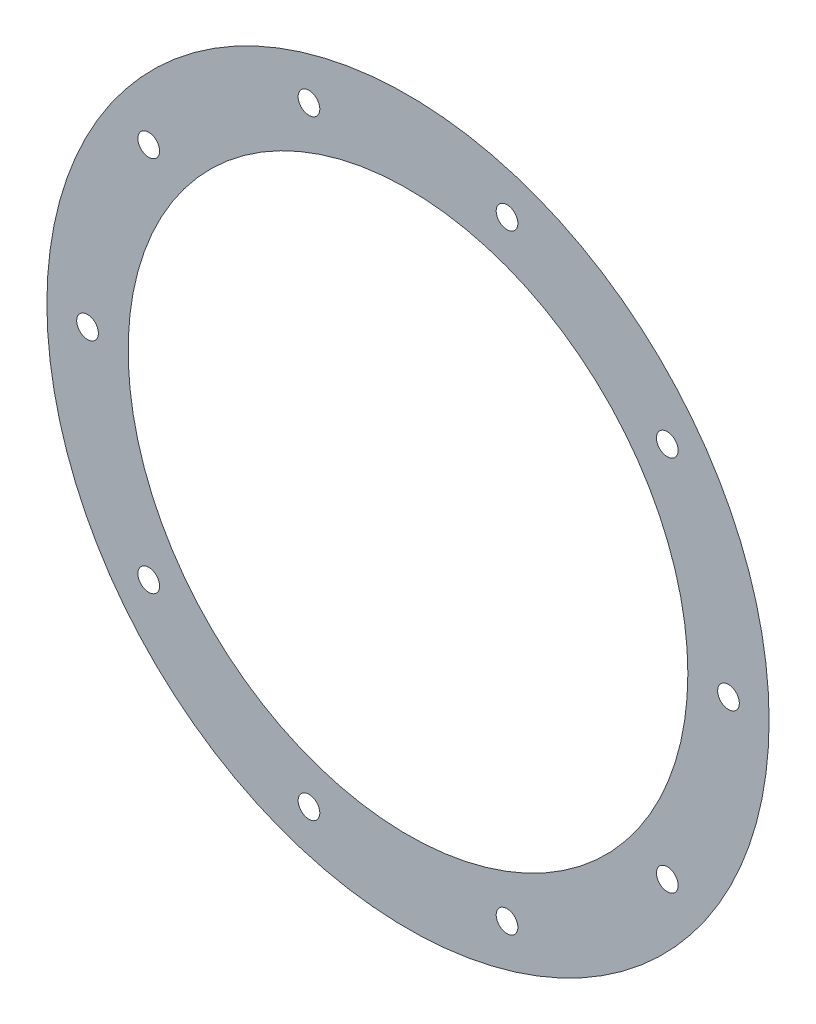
from build123d import *

# Parameters (mm, degrees)
SKETCH1_R               = 200
SKETCH1_R_2             = 155
BOSS_EXTRUDE1_DEPTH     = 0.0001
CUT_EXTRUDE4_DEPTH      = 30
CUT_EXTRUDE4_DEPTH_BACK = 30
SKETCH2_R               = 6


with BuildPart() as part:
    # Sketch1 → Boss-Extrude1 (new body)
    with BuildSketch(Plane.XY):
        Circle(SKETCH1_R)
        Circle(SKETCH1_R_2, mode=Mode.SUBTRACT)
    extrude(amount=BOSS_EXTRUDE1_DEPTH)

    # Sketch2 → Cut-Extrude4 (cut, two sides: drawn at the far end of the back side and taken through both)
    with BuildSketch(Plane.XY.offset(-CUT_EXTRUDE4_DEPTH_BACK)):
        with Locations((-177.5, 0)):
            Circle(SKETCH2_R)
        with Locations((-143.600516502, 104.331882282)):
            Circle(SKETCH2_R)
        with Locations((-54.850516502, 168.812531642)):
            Circle(SKETCH2_R)
        with Locations((54.850516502, 168.812531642)):
            Circle(SKETCH2_R)
        with Locations((143.600516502, 104.331882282)):
            Circle(SKETCH2_R)
        with Locations((177.5, 0)):
            Circle(SKETCH2_R)
        with Locations((143.600516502, -104.331882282)):
            Circle(SKETCH2_R)
        with Locations((54.850516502, -168.812531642)):
            Circle(SKETCH2_R)
        with Locations((-54.850516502, -168.812531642)):
            Circle(SKETCH2_R)
        with Locations((-143.600516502, -104.331882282)):
            Circle(SKETCH2_R)
    extrude(amount=CUT_EXTRUDE4_DEPTH + CUT_EXTRUDE4_DEPTH_BACK, mode=Mode.SUBTRACT)


solid = part.part
